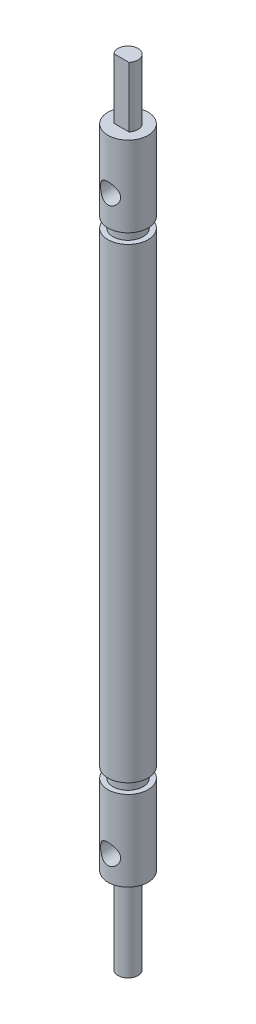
from build123d import *

# Parameters (mm, degrees)
CUT_EXTRUDE3_DEPTH      = 80.050616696
CUT_EXTRUDE3_DEPTH_BACK = 80.050616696
SKETCH4_R               = 1
CUT_EXTRUDE5_START      = -6
CUT_EXTRUDE5_DEPTH      = 6


with BuildPart() as part:
    # Sketch1 → Revolve1 (revolve)
    with BuildSketch(Plane.XY, mode=Mode.PRIVATE) as revolve1_sk:
        Polygon((0, 0), (0, 79), (1, 79), (1, 73), (2, 73), (2, 65), (1.5, 65), (1.5, 64), (2, 64), (2, 17.544461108), (1.5, 17.544461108), (1.5, 16.544461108), (2, 16.544461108), (2, 8.544461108), (1, 8.544461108), (1, 0), align=None)
    revolve(revolve1_sk.sketch.rotate(Axis((0, 0, 0), (0, 1, 0)), 90), axis=Axis((0, 0, 0), (0, 1, 0)))

    # Sketch4 → Cut-Extrude3 (cut, two sides: drawn at the far end of the back side and taken through both)
    with BuildSketch(Plane.XY.offset(-CUT_EXTRUDE3_DEPTH_BACK)):
        with Locations((0, 11)):
            Circle(SKETCH4_R)
        with Locations((0, 68)):
            Circle(SKETCH4_R)
    extrude(amount=CUT_EXTRUDE3_DEPTH + CUT_EXTRUDE3_DEPTH_BACK, mode=Mode.SUBTRACT)

    # Sketch5 → Cut-Extrude5 (cut)
    with BuildSketch(Plane(origin=(0, 79, 0), x_dir=(-1, 0, 0), z_dir=(0, 1, 0)).offset(CUT_EXTRUDE5_START)):
        with BuildLine():
            Line((0.75, 0.661437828), (-0.75, 0.661437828))
            ThreePointArc((-0.75, 0.661437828), (0, 1), (0.75, 0.661437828))
        make_face()
    extrude(amount=CUT_EXTRUDE5_DEPTH, mode=Mode.SUBTRACT)


solid = part.part
